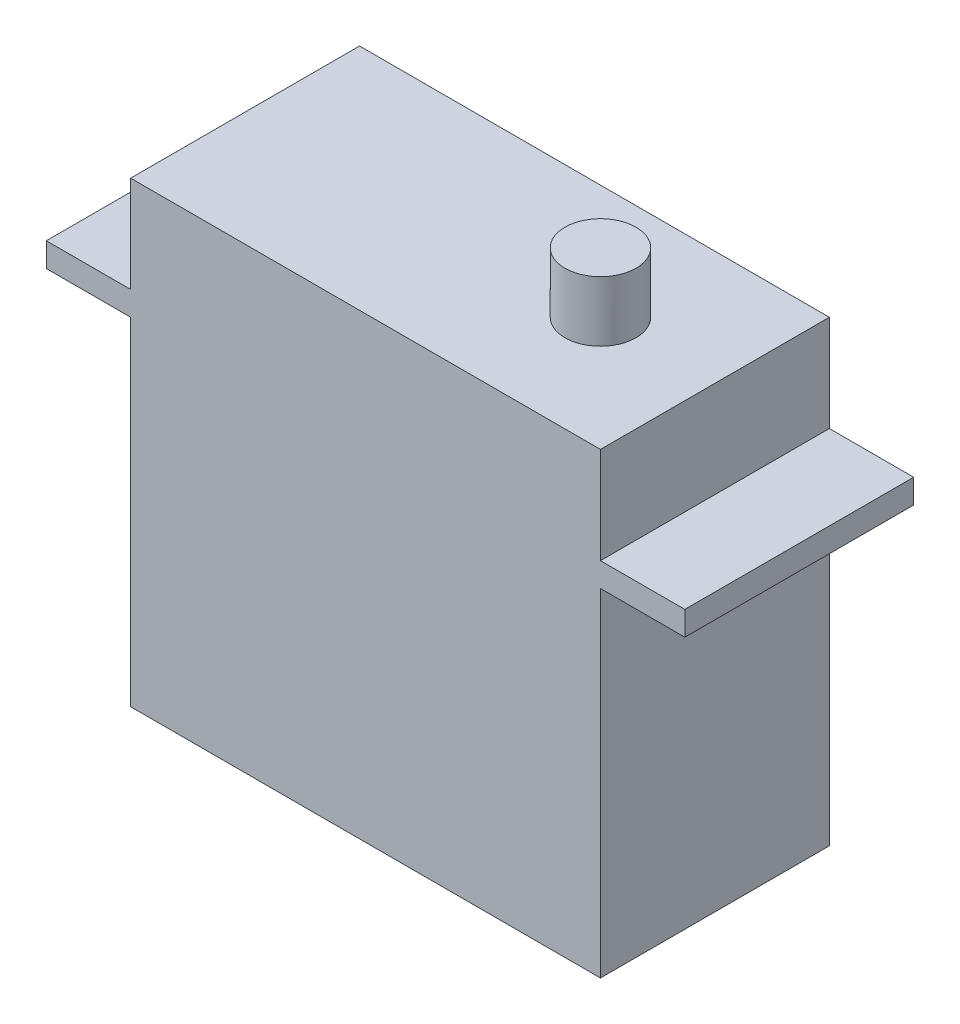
ISO-10303-21;
HEADER;
FILE_DESCRIPTION(('STEP AP214'),'2;1');
FILE_NAME('part.step','',(''),(''),'','','');
FILE_SCHEMA(('AUTOMOTIVE_DESIGN { 1 0 10303 214 1 1 1 1 }'));
ENDSEC;
DATA;
#1=APPLICATION_CONTEXT('core data for automotive mechanical design processes');
#2=APPLICATION_PROTOCOL_DEFINITION('international standard','automotive_design',2000,#1);
#3=PRODUCT_CONTEXT('',#1,'mechanical');
#4=PRODUCT('Part','Part','',(#3));
#5=PRODUCT_RELATED_PRODUCT_CATEGORY('part','',(#4));
#6=PRODUCT_DEFINITION_FORMATION('','',#4);
#7=PRODUCT_DEFINITION_CONTEXT('part definition',#1,'design');
#8=PRODUCT_DEFINITION('design','',#6,#7);
#9=PRODUCT_DEFINITION_SHAPE('','',#8);
#10=(LENGTH_UNIT() NAMED_UNIT(*) SI_UNIT(.MILLI.,.METRE.));
#11=(NAMED_UNIT(*) PLANE_ANGLE_UNIT() SI_UNIT($,.RADIAN.));
#12=(NAMED_UNIT(*) SI_UNIT($,.STERADIAN.) SOLID_ANGLE_UNIT());
#13=UNCERTAINTY_MEASURE_WITH_UNIT(LENGTH_MEASURE(1.E-05),#10,'distance_accuracy_value','');
#14=(GEOMETRIC_REPRESENTATION_CONTEXT(3) GLOBAL_UNCERTAINTY_ASSIGNED_CONTEXT((#13)) GLOBAL_UNIT_ASSIGNED_CONTEXT((#10,
#11,#12)) REPRESENTATION_CONTEXT('',''));
#15=CARTESIAN_POINT('',(0.,0.,0.));
#16=DIRECTION('',(0.,0.,1.));
#17=DIRECTION('',(1.,0.,0.));
#18=AXIS2_PLACEMENT_3D('',#15,#16,#17);
#19=CARTESIAN_POINT('',(0.,0.,19.));
#20=DIRECTION('',(0.,1.,0.));
#21=DIRECTION('',(0.,0.,1.));
#22=AXIS2_PLACEMENT_3D('',#19,#20,#21);
#23=PLANE('',#22);
#24=DIRECTION('',(1.,0.,0.));
#25=VECTOR('',#24,1.);
#26=CARTESIAN_POINT('',(0.,0.,0.));
#27=LINE('',#26,#25);
#28=CARTESIAN_POINT('',(0.,0.,0.));
#29=VERTEX_POINT('',#28);
#30=CARTESIAN_POINT('',(39.,0.,0.));
#31=VERTEX_POINT('',#30);
#32=EDGE_CURVE('E172',#29,#31,#27,.T.);
#33=ORIENTED_EDGE('',*,*,#32,.T.);
#34=DIRECTION('',(0.,0.,-1.));
#35=VECTOR('',#34,1.);
#36=CARTESIAN_POINT('',(39.,0.,19.));
#37=LINE('',#36,#35);
#38=CARTESIAN_POINT('',(39.,0.,19.));
#39=VERTEX_POINT('',#38);
#40=EDGE_CURVE('E54',#39,#31,#37,.T.);
#41=ORIENTED_EDGE('',*,*,#40,.F.);
#42=DIRECTION('',(1.,0.,0.));
#43=VECTOR('',#42,1.);
#44=CARTESIAN_POINT('',(0.,0.,19.));
#45=LINE('',#44,#43);
#46=CARTESIAN_POINT('',(0.,0.,19.));
#47=VERTEX_POINT('',#46);
#48=EDGE_CURVE('E214',#47,#39,#45,.T.);
#49=ORIENTED_EDGE('',*,*,#48,.F.);
#50=DIRECTION('',(0.,0.,-1.));
#51=VECTOR('',#50,1.);
#52=CARTESIAN_POINT('',(0.,0.,19.));
#53=LINE('',#52,#51);
#54=EDGE_CURVE('E62',#47,#29,#53,.T.);
#55=ORIENTED_EDGE('',*,*,#54,.T.);
#56=EDGE_LOOP('',(#33,#41,#49,#55));
#57=FACE_BOUND('',#56,.T.);
#58=ADVANCED_FACE('F45',(#57),#23,.F.);
#59=CARTESIAN_POINT('',(39.,0.,19.));
#60=DIRECTION('',(-1.,0.,0.));
#61=DIRECTION('',(0.,0.,1.));
#62=AXIS2_PLACEMENT_3D('',#59,#60,#61);
#63=PLANE('',#62);
#64=DIRECTION('',(0.,1.,0.));
#65=VECTOR('',#64,1.);
#66=CARTESIAN_POINT('',(39.,0.,0.));
#67=LINE('',#66,#65);
#68=CARTESIAN_POINT('',(39.,28.,0.));
#69=VERTEX_POINT('',#68);
#70=EDGE_CURVE('E175',#31,#69,#67,.T.);
#71=ORIENTED_EDGE('',*,*,#70,.T.);
#72=DIRECTION('',(0.,0.,-1.));
#73=VECTOR('',#72,1.);
#74=CARTESIAN_POINT('',(39.,28.,19.));
#75=LINE('',#74,#73);
#76=CARTESIAN_POINT('',(39.,28.,19.));
#77=VERTEX_POINT('',#76);
#78=EDGE_CURVE('E241',#77,#69,#75,.T.);
#79=ORIENTED_EDGE('',*,*,#78,.F.);
#80=DIRECTION('',(0.,1.,0.));
#81=VECTOR('',#80,1.);
#82=CARTESIAN_POINT('',(39.,0.,19.));
#83=LINE('',#82,#81);
#84=EDGE_CURVE('E113',#39,#77,#83,.T.);
#85=ORIENTED_EDGE('',*,*,#84,.F.);
#86=ORIENTED_EDGE('',*,*,#40,.T.);
#87=EDGE_LOOP('',(#71,#79,#85,#86));
#88=FACE_BOUND('',#87,.T.);
#89=ADVANCED_FACE('F246',(#88),#63,.F.);
#90=CARTESIAN_POINT('',(0.,28.,19.));
#91=DIRECTION('',(0.,1.,0.));
#92=DIRECTION('',(0.,0.,1.));
#93=AXIS2_PLACEMENT_3D('',#90,#91,#92);
#94=PLANE('',#93);
#95=DIRECTION('',(1.,0.,0.));
#96=VECTOR('',#95,1.);
#97=CARTESIAN_POINT('',(0.,28.,0.));
#98=LINE('',#97,#96);
#99=CARTESIAN_POINT('',(46.,28.,0.));
#100=VERTEX_POINT('',#99);
#101=EDGE_CURVE('E179',#69,#100,#98,.T.);
#102=ORIENTED_EDGE('',*,*,#101,.T.);
#103=DIRECTION('',(0.,0.,-1.));
#104=VECTOR('',#103,1.);
#105=CARTESIAN_POINT('',(46.,28.,19.));
#106=LINE('',#105,#104);
#107=CARTESIAN_POINT('',(46.,28.,19.));
#108=VERTEX_POINT('',#107);
#109=EDGE_CURVE('E237',#108,#100,#106,.T.);
#110=ORIENTED_EDGE('',*,*,#109,.F.);
#111=DIRECTION('',(1.,0.,0.));
#112=VECTOR('',#111,1.);
#113=CARTESIAN_POINT('',(0.,28.,19.));
#114=LINE('',#113,#112);
#115=EDGE_CURVE('E460',#77,#108,#114,.T.);
#116=ORIENTED_EDGE('',*,*,#115,.F.);
#117=ORIENTED_EDGE('',*,*,#78,.T.);
#118=EDGE_LOOP('',(#102,#110,#116,#117));
#119=FACE_BOUND('',#118,.T.);
#120=ADVANCED_FACE('F264',(#119),#94,.F.);
#121=CARTESIAN_POINT('',(46.,0.,19.));
#122=DIRECTION('',(-1.,0.,0.));
#123=DIRECTION('',(0.,0.,1.));
#124=AXIS2_PLACEMENT_3D('',#121,#122,#123);
#125=PLANE('',#124);
#126=DIRECTION('',(0.,1.,0.));
#127=VECTOR('',#126,1.);
#128=CARTESIAN_POINT('',(46.,0.,0.));
#129=LINE('',#128,#127);
#130=CARTESIAN_POINT('',(46.,30.,0.));
#131=VERTEX_POINT('',#130);
#132=EDGE_CURVE('E182',#100,#131,#129,.T.);
#133=ORIENTED_EDGE('',*,*,#132,.T.);
#134=DIRECTION('',(0.,0.,-1.));
#135=VECTOR('',#134,1.);
#136=CARTESIAN_POINT('',(46.,30.,19.));
#137=LINE('',#136,#135);
#138=CARTESIAN_POINT('',(46.,30.,19.));
#139=VERTEX_POINT('',#138);
#140=EDGE_CURVE('E234',#139,#131,#137,.T.);
#141=ORIENTED_EDGE('',*,*,#140,.F.);
#142=DIRECTION('',(0.,1.,0.));
#143=VECTOR('',#142,1.);
#144=CARTESIAN_POINT('',(46.,0.,19.));
#145=LINE('',#144,#143);
#146=EDGE_CURVE('E463',#108,#139,#145,.T.);
#147=ORIENTED_EDGE('',*,*,#146,.F.);
#148=ORIENTED_EDGE('',*,*,#109,.T.);
#149=EDGE_LOOP('',(#133,#141,#147,#148));
#150=FACE_BOUND('',#149,.T.);
#151=ADVANCED_FACE('F268',(#150),#125,.F.);
#152=CARTESIAN_POINT('',(0.,30.,19.));
#153=DIRECTION('',(0.,1.,0.));
#154=DIRECTION('',(0.,0.,1.));
#155=AXIS2_PLACEMENT_3D('',#152,#153,#154);
#156=PLANE('',#155);
#157=DIRECTION('',(1.,0.,0.));
#158=VECTOR('',#157,1.);
#159=CARTESIAN_POINT('',(0.,30.,0.));
#160=LINE('',#159,#158);
#161=CARTESIAN_POINT('',(39.,30.,0.));
#162=VERTEX_POINT('',#161);
#163=EDGE_CURVE('E186',#162,#131,#160,.T.);
#164=ORIENTED_EDGE('',*,*,#163,.F.);
#165=DIRECTION('',(0.,0.,-1.));
#166=VECTOR('',#165,1.);
#167=CARTESIAN_POINT('',(39.,30.,19.));
#168=LINE('',#167,#166);
#169=CARTESIAN_POINT('',(39.,30.,19.));
#170=VERTEX_POINT('',#169);
#171=EDGE_CURVE('E231',#170,#162,#168,.T.);
#172=ORIENTED_EDGE('',*,*,#171,.F.);
#173=DIRECTION('',(1.,0.,0.));
#174=VECTOR('',#173,1.);
#175=CARTESIAN_POINT('',(0.,30.,19.));
#176=LINE('',#175,#174);
#177=EDGE_CURVE('E466',#170,#139,#176,.T.);
#178=ORIENTED_EDGE('',*,*,#177,.T.);
#179=ORIENTED_EDGE('',*,*,#140,.T.);
#180=EDGE_LOOP('',(#164,#172,#178,#179));
#181=FACE_BOUND('',#180,.T.);
#182=ADVANCED_FACE('F274',(#181),#156,.T.);
#183=CARTESIAN_POINT('',(39.,0.,19.));
#184=DIRECTION('',(-1.,0.,0.));
#185=DIRECTION('',(0.,0.,1.));
#186=AXIS2_PLACEMENT_3D('',#183,#184,#185);
#187=PLANE('',#186);
#188=DIRECTION('',(0.,1.,0.));
#189=VECTOR('',#188,1.);
#190=CARTESIAN_POINT('',(39.,0.,0.));
#191=LINE('',#190,#189);
#192=CARTESIAN_POINT('',(39.,38.,0.));
#193=VERTEX_POINT('',#192);
#194=EDGE_CURVE('E190',#162,#193,#191,.T.);
#195=ORIENTED_EDGE('',*,*,#194,.T.);
#196=DIRECTION('',(0.,0.,-1.));
#197=VECTOR('',#196,1.);
#198=CARTESIAN_POINT('',(39.,38.,19.));
#199=LINE('',#198,#197);
#200=CARTESIAN_POINT('',(39.,38.,19.));
#201=VERTEX_POINT('',#200);
#202=EDGE_CURVE('E227',#201,#193,#199,.T.);
#203=ORIENTED_EDGE('',*,*,#202,.F.);
#204=DIRECTION('',(0.,1.,0.));
#205=VECTOR('',#204,1.);
#206=CARTESIAN_POINT('',(39.,0.,19.));
#207=LINE('',#206,#205);
#208=EDGE_CURVE('E470',#170,#201,#207,.T.);
#209=ORIENTED_EDGE('',*,*,#208,.F.);
#210=ORIENTED_EDGE('',*,*,#171,.T.);
#211=EDGE_LOOP('',(#195,#203,#209,#210));
#212=FACE_BOUND('',#211,.T.);
#213=ADVANCED_FACE('F278',(#212),#187,.F.);
#214=CARTESIAN_POINT('',(0.,38.,19.));
#215=DIRECTION('',(0.,-1.,0.));
#216=DIRECTION('',(0.,0.,-1.));
#217=AXIS2_PLACEMENT_3D('',#214,#215,#216);
#218=PLANE('',#217);
#219=CARTESIAN_POINT('',(29.5,38.,9.5));
#220=DIRECTION('',(0.,-1.,0.));
#221=DIRECTION('',(0.,0.,-1.));
#222=AXIS2_PLACEMENT_3D('',#219,#220,#221);
#223=CIRCLE('',#222,2.95);
#224=CARTESIAN_POINT('',(29.5,38.,6.55));
#225=VERTEX_POINT('',#224);
#226=EDGE_CURVE('E11',#225,#225,#223,.F.);
#227=ORIENTED_EDGE('',*,*,#226,.F.);
#228=EDGE_LOOP('',(#227));
#229=FACE_BOUND('',#228,.T.);
#230=DIRECTION('',(-1.,0.,0.));
#231=VECTOR('',#230,1.);
#232=CARTESIAN_POINT('',(0.,38.,0.));
#233=LINE('',#232,#231);
#234=CARTESIAN_POINT('',(0.,38.,0.));
#235=VERTEX_POINT('',#234);
#236=EDGE_CURVE('E193',#193,#235,#233,.T.);
#237=ORIENTED_EDGE('',*,*,#236,.T.);
#238=DIRECTION('',(0.,0.,-1.));
#239=VECTOR('',#238,1.);
#240=CARTESIAN_POINT('',(0.,38.,19.));
#241=LINE('',#240,#239);
#242=CARTESIAN_POINT('',(0.,38.,19.));
#243=VERTEX_POINT('',#242);
#244=EDGE_CURVE('E224',#243,#235,#241,.T.);
#245=ORIENTED_EDGE('',*,*,#244,.F.);
#246=DIRECTION('',(-1.,0.,0.));
#247=VECTOR('',#246,1.);
#248=CARTESIAN_POINT('',(0.,38.,19.));
#249=LINE('',#248,#247);
#250=EDGE_CURVE('E473',#201,#243,#249,.T.);
#251=ORIENTED_EDGE('',*,*,#250,.F.);
#252=ORIENTED_EDGE('',*,*,#202,.T.);
#253=EDGE_LOOP('',(#237,#245,#251,#252));
#254=FACE_BOUND('',#253,.T.);
#255=ADVANCED_FACE('F282',(#229,#254),#218,.F.);
#256=CARTESIAN_POINT('',(0.,0.,19.));
#257=DIRECTION('',(-1.,0.,0.));
#258=DIRECTION('',(0.,-1.,0.));
#259=AXIS2_PLACEMENT_3D('',#256,#257,#258);
#260=PLANE('',#259);
#261=DIRECTION('',(0.,1.,0.));
#262=VECTOR('',#261,1.);
#263=CARTESIAN_POINT('',(0.,0.,0.));
#264=LINE('',#263,#262);
#265=CARTESIAN_POINT('',(0.,30.,0.));
#266=VERTEX_POINT('',#265);
#267=EDGE_CURVE('E197',#266,#235,#264,.T.);
#268=ORIENTED_EDGE('',*,*,#267,.F.);
#269=DIRECTION('',(0.,0.,-1.));
#270=VECTOR('',#269,1.);
#271=CARTESIAN_POINT('',(0.,30.,19.));
#272=LINE('',#271,#270);
#273=CARTESIAN_POINT('',(0.,30.,19.));
#274=VERTEX_POINT('',#273);
#275=EDGE_CURVE('E221',#274,#266,#272,.T.);
#276=ORIENTED_EDGE('',*,*,#275,.F.);
#277=DIRECTION('',(0.,1.,0.));
#278=VECTOR('',#277,1.);
#279=CARTESIAN_POINT('',(0.,0.,19.));
#280=LINE('',#279,#278);
#281=EDGE_CURVE('E476',#274,#243,#280,.T.);
#282=ORIENTED_EDGE('',*,*,#281,.T.);
#283=ORIENTED_EDGE('',*,*,#244,.T.);
#284=EDGE_LOOP('',(#268,#276,#282,#283));
#285=FACE_BOUND('',#284,.T.);
#286=ADVANCED_FACE('F286',(#285),#260,.T.);
#287=CARTESIAN_POINT('',(0.,30.,19.));
#288=DIRECTION('',(0.,-1.,0.));
#289=DIRECTION('',(0.,0.,-1.));
#290=AXIS2_PLACEMENT_3D('',#287,#288,#289);
#291=PLANE('',#290);
#292=DIRECTION('',(-1.,0.,0.));
#293=VECTOR('',#292,1.);
#294=CARTESIAN_POINT('',(0.,30.,0.));
#295=LINE('',#294,#293);
#296=CARTESIAN_POINT('',(-6.99999999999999,30.,0.));
#297=VERTEX_POINT('',#296);
#298=EDGE_CURVE('E201',#266,#297,#295,.T.);
#299=ORIENTED_EDGE('',*,*,#298,.T.);
#300=DIRECTION('',(0.,0.,-1.));
#301=VECTOR('',#300,1.);
#302=CARTESIAN_POINT('',(-6.99999999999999,30.,19.));
#303=LINE('',#302,#301);
#304=CARTESIAN_POINT('',(-6.99999999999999,30.,19.));
#305=VERTEX_POINT('',#304);
#306=EDGE_CURVE('E151',#305,#297,#303,.T.);
#307=ORIENTED_EDGE('',*,*,#306,.F.);
#308=DIRECTION('',(-1.,0.,0.));
#309=VECTOR('',#308,1.);
#310=CARTESIAN_POINT('',(0.,30.,19.));
#311=LINE('',#310,#309);
#312=EDGE_CURVE('E160',#274,#305,#311,.T.);
#313=ORIENTED_EDGE('',*,*,#312,.F.);
#314=ORIENTED_EDGE('',*,*,#275,.T.);
#315=EDGE_LOOP('',(#299,#307,#313,#314));
#316=FACE_BOUND('',#315,.T.);
#317=ADVANCED_FACE('F290',(#316),#291,.F.);
#318=CARTESIAN_POINT('',(-6.99999999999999,0.,19.));
#319=DIRECTION('',(-1.,0.,0.));
#320=DIRECTION('',(0.,0.,1.));
#321=AXIS2_PLACEMENT_3D('',#318,#319,#320);
#322=PLANE('',#321);
#323=DIRECTION('',(0.,1.,0.));
#324=VECTOR('',#323,1.);
#325=CARTESIAN_POINT('',(-6.99999999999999,0.,0.));
#326=LINE('',#325,#324);
#327=CARTESIAN_POINT('',(-6.99999999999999,28.,0.));
#328=VERTEX_POINT('',#327);
#329=EDGE_CURVE('E146',#328,#297,#326,.T.);
#330=ORIENTED_EDGE('',*,*,#329,.F.);
#331=DIRECTION('',(0.,0.,-1.));
#332=VECTOR('',#331,1.);
#333=CARTESIAN_POINT('',(-6.99999999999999,28.,19.));
#334=LINE('',#333,#332);
#335=CARTESIAN_POINT('',(-6.99999999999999,28.,19.));
#336=VERTEX_POINT('',#335);
#337=EDGE_CURVE('E141',#336,#328,#334,.T.);
#338=ORIENTED_EDGE('',*,*,#337,.F.);
#339=DIRECTION('',(0.,1.,0.));
#340=VECTOR('',#339,1.);
#341=CARTESIAN_POINT('',(-6.99999999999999,0.,19.));
#342=LINE('',#341,#340);
#343=EDGE_CURVE('E144',#336,#305,#342,.T.);
#344=ORIENTED_EDGE('',*,*,#343,.T.);
#345=ORIENTED_EDGE('',*,*,#306,.T.);
#346=EDGE_LOOP('',(#330,#338,#344,#345));
#347=FACE_BOUND('',#346,.T.);
#348=ADVANCED_FACE('F143',(#347),#322,.T.);
#349=CARTESIAN_POINT('',(0.,28.,19.));
#350=DIRECTION('',(0.,-1.,0.));
#351=DIRECTION('',(1.,0.,0.));
#352=AXIS2_PLACEMENT_3D('',#349,#350,#351);
#353=PLANE('',#352);
#354=DIRECTION('',(-1.,0.,0.));
#355=VECTOR('',#354,1.);
#356=CARTESIAN_POINT('',(0.,28.,0.));
#357=LINE('',#356,#355);
#358=CARTESIAN_POINT('',(0.,28.,0.));
#359=VERTEX_POINT('',#358);
#360=EDGE_CURVE('E207',#359,#328,#357,.T.);
#361=ORIENTED_EDGE('',*,*,#360,.F.);
#362=DIRECTION('',(0.,0.,-1.));
#363=VECTOR('',#362,1.);
#364=CARTESIAN_POINT('',(0.,28.,19.));
#365=LINE('',#364,#363);
#366=CARTESIAN_POINT('',(0.,28.,19.));
#367=VERTEX_POINT('',#366);
#368=EDGE_CURVE('E100',#367,#359,#365,.T.);
#369=ORIENTED_EDGE('',*,*,#368,.F.);
#370=DIRECTION('',(-1.,0.,0.));
#371=VECTOR('',#370,1.);
#372=CARTESIAN_POINT('',(0.,28.,19.));
#373=LINE('',#372,#371);
#374=EDGE_CURVE('E157',#367,#336,#373,.T.);
#375=ORIENTED_EDGE('',*,*,#374,.T.);
#376=ORIENTED_EDGE('',*,*,#337,.T.);
#377=EDGE_LOOP('',(#361,#369,#375,#376));
#378=FACE_BOUND('',#377,.T.);
#379=ADVANCED_FACE('F164',(#378),#353,.T.);
#380=CARTESIAN_POINT('',(0.,0.,19.));
#381=DIRECTION('',(-1.,0.,0.));
#382=DIRECTION('',(0.,-1.,0.));
#383=AXIS2_PLACEMENT_3D('',#380,#381,#382);
#384=PLANE('',#383);
#385=DIRECTION('',(0.,1.,0.));
#386=VECTOR('',#385,1.);
#387=CARTESIAN_POINT('',(0.,0.,0.));
#388=LINE('',#387,#386);
#389=EDGE_CURVE('E210',#29,#359,#388,.T.);
#390=ORIENTED_EDGE('',*,*,#389,.F.);
#391=ORIENTED_EDGE('',*,*,#54,.F.);
#392=DIRECTION('',(0.,1.,0.));
#393=VECTOR('',#392,1.);
#394=CARTESIAN_POINT('',(0.,0.,19.));
#395=LINE('',#394,#393);
#396=EDGE_CURVE('E166',#47,#367,#395,.T.);
#397=ORIENTED_EDGE('',*,*,#396,.T.);
#398=ORIENTED_EDGE('',*,*,#368,.T.);
#399=EDGE_LOOP('',(#390,#391,#397,#398));
#400=FACE_BOUND('',#399,.T.);
#401=ADVANCED_FACE('F250',(#400),#384,.T.);
#402=CARTESIAN_POINT('',(0.,0.,19.));
#403=DIRECTION('',(0.,0.,1.));
#404=DIRECTION('',(1.,0.,0.));
#405=AXIS2_PLACEMENT_3D('',#402,#403,#404);
#406=PLANE('',#405);
#407=ORIENTED_EDGE('',*,*,#48,.T.);
#408=ORIENTED_EDGE('',*,*,#84,.T.);
#409=ORIENTED_EDGE('',*,*,#115,.T.);
#410=ORIENTED_EDGE('',*,*,#146,.T.);
#411=ORIENTED_EDGE('',*,*,#177,.F.);
#412=ORIENTED_EDGE('',*,*,#208,.T.);
#413=ORIENTED_EDGE('',*,*,#250,.T.);
#414=ORIENTED_EDGE('',*,*,#281,.F.);
#415=ORIENTED_EDGE('',*,*,#312,.T.);
#416=ORIENTED_EDGE('',*,*,#343,.F.);
#417=ORIENTED_EDGE('',*,*,#374,.F.);
#418=ORIENTED_EDGE('',*,*,#396,.F.);
#419=EDGE_LOOP('',(#407,#408,#409,#410,#411,#412,#413,#414,#415,#416,#417,#418));
#420=FACE_BOUND('',#419,.T.);
#421=ADVANCED_FACE('F155',(#420),#406,.T.);
#422=CARTESIAN_POINT('',(0.,0.,0.));
#423=DIRECTION('',(0.,0.,1.));
#424=DIRECTION('',(1.,0.,0.));
#425=AXIS2_PLACEMENT_3D('',#422,#423,#424);
#426=PLANE('',#425);
#427=ORIENTED_EDGE('',*,*,#32,.F.);
#428=ORIENTED_EDGE('',*,*,#389,.T.);
#429=ORIENTED_EDGE('',*,*,#360,.T.);
#430=ORIENTED_EDGE('',*,*,#329,.T.);
#431=ORIENTED_EDGE('',*,*,#298,.F.);
#432=ORIENTED_EDGE('',*,*,#267,.T.);
#433=ORIENTED_EDGE('',*,*,#236,.F.);
#434=ORIENTED_EDGE('',*,*,#194,.F.);
#435=ORIENTED_EDGE('',*,*,#163,.T.);
#436=ORIENTED_EDGE('',*,*,#132,.F.);
#437=ORIENTED_EDGE('',*,*,#101,.F.);
#438=ORIENTED_EDGE('',*,*,#70,.F.);
#439=EDGE_LOOP('',(#427,#428,#429,#430,#431,#432,#433,#434,#435,#436,#437,#438));
#440=FACE_BOUND('',#439,.T.);
#441=ADVANCED_FACE('F248',(#440),#426,.F.);
#442=CARTESIAN_POINT('',(29.5,43.,9.5));
#443=DIRECTION('',(0.,-1.,0.));
#444=DIRECTION('',(0.,0.,-1.));
#445=AXIS2_PLACEMENT_3D('',#442,#443,#444);
#446=CYLINDRICAL_SURFACE('',#445,2.95);
#447=CARTESIAN_POINT('',(29.5,43.,9.5));
#448=DIRECTION('',(0.,1.,0.));
#449=DIRECTION('',(0.,0.,1.));
#450=AXIS2_PLACEMENT_3D('',#447,#448,#449);
#451=CIRCLE('',#450,2.95);
#452=CARTESIAN_POINT('',(29.5,43.,12.45));
#453=VERTEX_POINT('',#452);
#454=EDGE_CURVE('E176',#453,#453,#451,.T.);
#455=ORIENTED_EDGE('',*,*,#454,.F.);
#456=EDGE_LOOP('',(#455));
#457=FACE_BOUND('',#456,.T.);
#458=ORIENTED_EDGE('',*,*,#226,.T.);
#459=EDGE_LOOP('',(#458));
#460=FACE_BOUND('',#459,.T.);
#461=ADVANCED_FACE('F328',(#457,#460),#446,.T.);
#462=CARTESIAN_POINT('',(29.5,43.,9.5));
#463=DIRECTION('',(0.,1.,0.));
#464=DIRECTION('',(0.,0.,1.));
#465=AXIS2_PLACEMENT_3D('',#462,#463,#464);
#466=PLANE('',#465);
#467=ORIENTED_EDGE('',*,*,#454,.T.);
#468=EDGE_LOOP('',(#467));
#469=FACE_BOUND('',#468,.T.);
#470=ADVANCED_FACE('F346',(#469),#466,.T.);
#471=CLOSED_SHELL('',(#58,#89,#120,#151,#182,#213,#255,#286,#317,#348,#379,#401,#421,#441,#461,#470));
#472=MANIFOLD_SOLID_BREP('B2',#471);
#473=ADVANCED_BREP_SHAPE_REPRESENTATION('',(#18,#472),#14);
#474=SHAPE_DEFINITION_REPRESENTATION(#9,#473);
ENDSEC;
END-ISO-10303-21;
